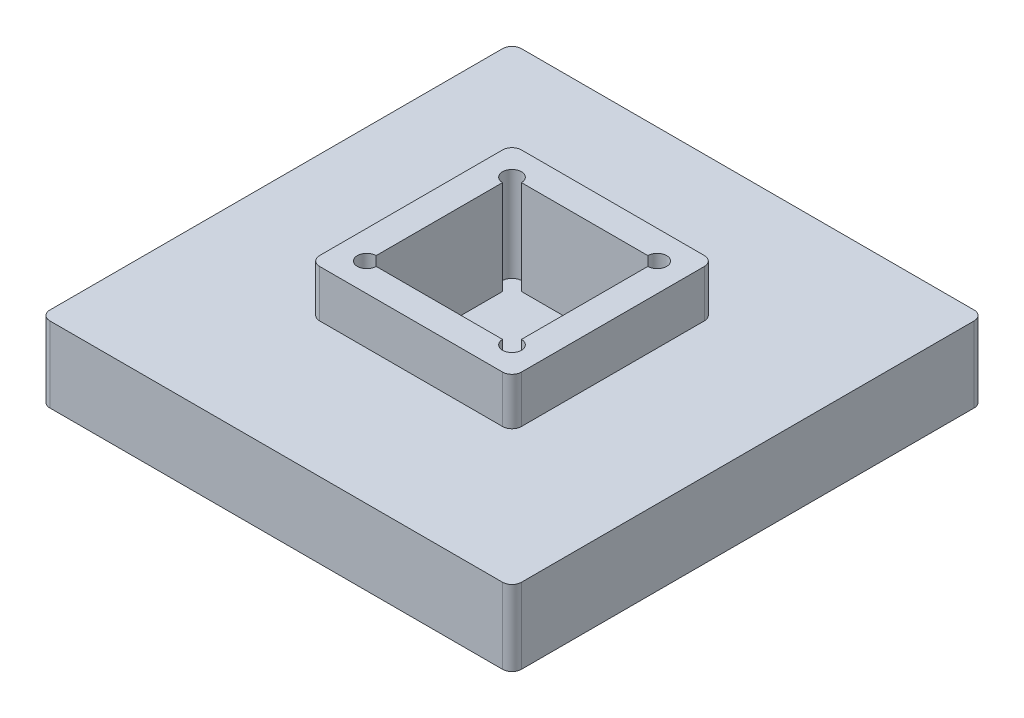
ISO-10303-21;
HEADER;
FILE_DESCRIPTION(('STEP AP214'),'2;1');
FILE_NAME('part.step','',(''),(''),'','','');
FILE_SCHEMA(('AUTOMOTIVE_DESIGN { 1 0 10303 214 1 1 1 1 }'));
ENDSEC;
DATA;
#1=APPLICATION_CONTEXT('core data for automotive mechanical design processes');
#2=APPLICATION_PROTOCOL_DEFINITION('international standard','automotive_design',2000,#1);
#3=PRODUCT_CONTEXT('',#1,'mechanical');
#4=PRODUCT('Part','Part','',(#3));
#5=PRODUCT_RELATED_PRODUCT_CATEGORY('part','',(#4));
#6=PRODUCT_DEFINITION_FORMATION('','',#4);
#7=PRODUCT_DEFINITION_CONTEXT('part definition',#1,'design');
#8=PRODUCT_DEFINITION('design','',#6,#7);
#9=PRODUCT_DEFINITION_SHAPE('','',#8);
#10=(LENGTH_UNIT() NAMED_UNIT(*) SI_UNIT(.MILLI.,.METRE.));
#11=(NAMED_UNIT(*) PLANE_ANGLE_UNIT() SI_UNIT($,.RADIAN.));
#12=(NAMED_UNIT(*) SI_UNIT($,.STERADIAN.) SOLID_ANGLE_UNIT());
#13=UNCERTAINTY_MEASURE_WITH_UNIT(LENGTH_MEASURE(1.E-05),#10,'distance_accuracy_value','');
#14=(GEOMETRIC_REPRESENTATION_CONTEXT(3) GLOBAL_UNCERTAINTY_ASSIGNED_CONTEXT((#13)) GLOBAL_UNIT_ASSIGNED_CONTEXT((#10,
#11,#12)) REPRESENTATION_CONTEXT('',''));
#15=CARTESIAN_POINT('',(0.,0.,0.));
#16=DIRECTION('',(0.,0.,1.));
#17=DIRECTION('',(1.,0.,0.));
#18=AXIS2_PLACEMENT_3D('',#15,#16,#17);
#19=CARTESIAN_POINT('',(0.,8.,0.));
#20=DIRECTION('',(0.,-1.,0.));
#21=DIRECTION('',(0.,0.,-1.));
#22=AXIS2_PLACEMENT_3D('',#19,#20,#21);
#23=PLANE('',#22);
#24=DIRECTION('',(-1.,0.,0.));
#25=VECTOR('',#24,1.);
#26=CARTESIAN_POINT('',(-25.,8.,-25.));
#27=LINE('',#26,#25);
#28=CARTESIAN_POINT('',(24.,8.,-25.));
#29=VERTEX_POINT('',#28);
#30=CARTESIAN_POINT('',(-24.,8.,-25.));
#31=VERTEX_POINT('',#30);
#32=EDGE_CURVE('E299',#29,#31,#27,.T.);
#33=ORIENTED_EDGE('',*,*,#32,.T.);
#34=CARTESIAN_POINT('',(-24.,8.,-24.));
#35=DIRECTION('',(0.,-1.,0.));
#36=DIRECTION('',(0.,0.,-1.));
#37=AXIS2_PLACEMENT_3D('',#34,#35,#36);
#38=CIRCLE('',#37,1.);
#39=CARTESIAN_POINT('',(-25.,8.,-24.));
#40=VERTEX_POINT('',#39);
#41=EDGE_CURVE('E367',#31,#40,#38,.F.);
#42=ORIENTED_EDGE('',*,*,#41,.T.);
#43=DIRECTION('',(0.,0.,1.));
#44=VECTOR('',#43,1.);
#45=CARTESIAN_POINT('',(-25.,8.,25.));
#46=LINE('',#45,#44);
#47=CARTESIAN_POINT('',(-25.,8.,24.));
#48=VERTEX_POINT('',#47);
#49=EDGE_CURVE('E303',#40,#48,#46,.T.);
#50=ORIENTED_EDGE('',*,*,#49,.T.);
#51=CARTESIAN_POINT('',(-24.,8.,24.));
#52=DIRECTION('',(0.,-1.,0.));
#53=DIRECTION('',(0.,0.,-1.));
#54=AXIS2_PLACEMENT_3D('',#51,#52,#53);
#55=CIRCLE('',#54,1.);
#56=CARTESIAN_POINT('',(-24.,8.,25.));
#57=VERTEX_POINT('',#56);
#58=EDGE_CURVE('E58',#48,#57,#55,.F.);
#59=ORIENTED_EDGE('',*,*,#58,.T.);
#60=DIRECTION('',(1.,0.,0.));
#61=VECTOR('',#60,1.);
#62=CARTESIAN_POINT('',(-25.,8.,25.));
#63=LINE('',#62,#61);
#64=CARTESIAN_POINT('',(24.,8.,25.));
#65=VERTEX_POINT('',#64);
#66=EDGE_CURVE('E305',#57,#65,#63,.T.);
#67=ORIENTED_EDGE('',*,*,#66,.T.);
#68=CARTESIAN_POINT('',(24.,8.,24.));
#69=DIRECTION('',(0.,-1.,0.));
#70=DIRECTION('',(0.,0.,-1.));
#71=AXIS2_PLACEMENT_3D('',#68,#69,#70);
#72=CIRCLE('',#71,1.);
#73=CARTESIAN_POINT('',(25.,8.,24.));
#74=VERTEX_POINT('',#73);
#75=EDGE_CURVE('E364',#65,#74,#72,.F.);
#76=ORIENTED_EDGE('',*,*,#75,.T.);
#77=DIRECTION('',(0.,0.,-1.));
#78=VECTOR('',#77,1.);
#79=CARTESIAN_POINT('',(25.,8.,25.));
#80=LINE('',#79,#78);
#81=CARTESIAN_POINT('',(25.,8.,-24.));
#82=VERTEX_POINT('',#81);
#83=EDGE_CURVE('E296',#74,#82,#80,.T.);
#84=ORIENTED_EDGE('',*,*,#83,.T.);
#85=CARTESIAN_POINT('',(24.,8.,-24.));
#86=DIRECTION('',(0.,-1.,0.));
#87=DIRECTION('',(0.,0.,-1.));
#88=AXIS2_PLACEMENT_3D('',#85,#86,#87);
#89=CIRCLE('',#88,1.);
#90=EDGE_CURVE('E362',#82,#29,#89,.F.);
#91=ORIENTED_EDGE('',*,*,#90,.T.);
#92=EDGE_LOOP('',(#33,#42,#50,#59,#67,#76,#84,#91));
#93=FACE_BOUND('',#92,.T.);
#94=DIRECTION('',(1.,0.,0.));
#95=VECTOR('',#94,1.);
#96=CARTESIAN_POINT('',(0.,8.,10.7));
#97=LINE('',#96,#95);
#98=CARTESIAN_POINT('',(-9.7,8.,10.7));
#99=VERTEX_POINT('',#98);
#100=CARTESIAN_POINT('',(9.7,8.,10.7));
#101=VERTEX_POINT('',#100);
#102=EDGE_CURVE('E239',#99,#101,#97,.T.);
#103=ORIENTED_EDGE('',*,*,#102,.F.);
#104=CARTESIAN_POINT('',(-9.7,8.,9.7));
#105=DIRECTION('',(0.,-1.,0.));
#106=DIRECTION('',(0.,0.,-1.));
#107=AXIS2_PLACEMENT_3D('',#104,#105,#106);
#108=CIRCLE('',#107,1.);
#109=CARTESIAN_POINT('',(-10.7,8.,9.7));
#110=VERTEX_POINT('',#109);
#111=EDGE_CURVE('E11',#99,#110,#108,.T.);
#112=ORIENTED_EDGE('',*,*,#111,.T.);
#113=DIRECTION('',(0.,0.,-1.));
#114=VECTOR('',#113,1.);
#115=CARTESIAN_POINT('',(-10.7,8.,0.));
#116=LINE('',#115,#114);
#117=CARTESIAN_POINT('',(-10.7,8.,-9.7));
#118=VERTEX_POINT('',#117);
#119=EDGE_CURVE('E244',#110,#118,#116,.T.);
#120=ORIENTED_EDGE('',*,*,#119,.T.);
#121=CARTESIAN_POINT('',(-9.7,8.,-9.7));
#122=DIRECTION('',(0.,-1.,0.));
#123=DIRECTION('',(0.,0.,-1.));
#124=AXIS2_PLACEMENT_3D('',#121,#122,#123);
#125=CIRCLE('',#124,1.);
#126=CARTESIAN_POINT('',(-9.7,8.,-10.7));
#127=VERTEX_POINT('',#126);
#128=EDGE_CURVE('E44',#118,#127,#125,.T.);
#129=ORIENTED_EDGE('',*,*,#128,.T.);
#130=DIRECTION('',(1.,0.,0.));
#131=VECTOR('',#130,1.);
#132=CARTESIAN_POINT('',(0.,8.,-10.7));
#133=LINE('',#132,#131);
#134=CARTESIAN_POINT('',(9.7,8.,-10.7));
#135=VERTEX_POINT('',#134);
#136=EDGE_CURVE('E279',#127,#135,#133,.T.);
#137=ORIENTED_EDGE('',*,*,#136,.T.);
#138=CARTESIAN_POINT('',(9.7,8.,-9.7));
#139=DIRECTION('',(0.,-1.,0.));
#140=DIRECTION('',(0.,0.,-1.));
#141=AXIS2_PLACEMENT_3D('',#138,#139,#140);
#142=CIRCLE('',#141,1.);
#143=CARTESIAN_POINT('',(10.7,8.,-9.7));
#144=VERTEX_POINT('',#143);
#145=EDGE_CURVE('E380',#135,#144,#142,.T.);
#146=ORIENTED_EDGE('',*,*,#145,.T.);
#147=DIRECTION('',(0.,0.,-1.));
#148=VECTOR('',#147,1.);
#149=CARTESIAN_POINT('',(10.7,8.,0.));
#150=LINE('',#149,#148);
#151=CARTESIAN_POINT('',(10.7,8.,9.7));
#152=VERTEX_POINT('',#151);
#153=EDGE_CURVE('E276',#152,#144,#150,.T.);
#154=ORIENTED_EDGE('',*,*,#153,.F.);
#155=CARTESIAN_POINT('',(9.7,8.,9.7));
#156=DIRECTION('',(0.,-1.,0.));
#157=DIRECTION('',(0.,0.,-1.));
#158=AXIS2_PLACEMENT_3D('',#155,#156,#157);
#159=CIRCLE('',#158,1.);
#160=EDGE_CURVE('E378',#152,#101,#159,.T.);
#161=ORIENTED_EDGE('',*,*,#160,.T.);
#162=EDGE_LOOP('',(#103,#112,#120,#129,#137,#146,#154,#161));
#163=FACE_BOUND('',#162,.T.);
#164=ADVANCED_FACE('F36',(#93,#163),#23,.F.);
#165=CARTESIAN_POINT('',(25.,8.,25.));
#166=DIRECTION('',(-1.,0.,0.));
#167=DIRECTION('',(0.,0.,1.));
#168=AXIS2_PLACEMENT_3D('',#165,#166,#167);
#169=PLANE('',#168);
#170=ORIENTED_EDGE('',*,*,#83,.F.);
#171=DIRECTION('',(0.,-1.,0.));
#172=VECTOR('',#171,1.);
#173=CARTESIAN_POINT('',(25.,8.,24.));
#174=LINE('',#173,#172);
#175=CARTESIAN_POINT('',(25.,0.,24.));
#176=VERTEX_POINT('',#175);
#177=EDGE_CURVE('E375',#74,#176,#174,.T.);
#178=ORIENTED_EDGE('',*,*,#177,.T.);
#179=DIRECTION('',(0.,0.,-1.));
#180=VECTOR('',#179,1.);
#181=CARTESIAN_POINT('',(25.,0.,25.));
#182=LINE('',#181,#180);
#183=CARTESIAN_POINT('',(25.,0.,-24.));
#184=VERTEX_POINT('',#183);
#185=EDGE_CURVE('E295',#176,#184,#182,.T.);
#186=ORIENTED_EDGE('',*,*,#185,.T.);
#187=DIRECTION('',(0.,-1.,0.));
#188=VECTOR('',#187,1.);
#189=CARTESIAN_POINT('',(25.,8.,-24.));
#190=LINE('',#189,#188);
#191=EDGE_CURVE('E373',#184,#82,#190,.F.);
#192=ORIENTED_EDGE('',*,*,#191,.T.);
#193=EDGE_LOOP('',(#170,#178,#186,#192));
#194=FACE_BOUND('',#193,.T.);
#195=ADVANCED_FACE('F429',(#194),#169,.F.);
#196=CARTESIAN_POINT('',(-25.,8.,-25.));
#197=DIRECTION('',(0.,0.,1.));
#198=DIRECTION('',(1.,0.,0.));
#199=AXIS2_PLACEMENT_3D('',#196,#197,#198);
#200=PLANE('',#199);
#201=DIRECTION('',(-1.,0.,0.));
#202=VECTOR('',#201,1.);
#203=CARTESIAN_POINT('',(-25.,0.,-25.));
#204=LINE('',#203,#202);
#205=CARTESIAN_POINT('',(24.,0.,-25.));
#206=VERTEX_POINT('',#205);
#207=CARTESIAN_POINT('',(-24.,0.,-25.));
#208=VERTEX_POINT('',#207);
#209=EDGE_CURVE('E310',#206,#208,#204,.T.);
#210=ORIENTED_EDGE('',*,*,#209,.T.);
#211=DIRECTION('',(0.,-1.,0.));
#212=VECTOR('',#211,1.);
#213=CARTESIAN_POINT('',(-24.,8.,-25.));
#214=LINE('',#213,#212);
#215=EDGE_CURVE('E360',#208,#31,#214,.F.);
#216=ORIENTED_EDGE('',*,*,#215,.T.);
#217=ORIENTED_EDGE('',*,*,#32,.F.);
#218=DIRECTION('',(0.,-1.,0.));
#219=VECTOR('',#218,1.);
#220=CARTESIAN_POINT('',(24.,8.,-25.));
#221=LINE('',#220,#219);
#222=EDGE_CURVE('E357',#29,#206,#221,.T.);
#223=ORIENTED_EDGE('',*,*,#222,.T.);
#224=EDGE_LOOP('',(#210,#216,#217,#223));
#225=FACE_BOUND('',#224,.T.);
#226=ADVANCED_FACE('F434',(#225),#200,.F.);
#227=CARTESIAN_POINT('',(-25.,8.,25.));
#228=DIRECTION('',(1.,0.,0.));
#229=DIRECTION('',(0.,0.,-1.));
#230=AXIS2_PLACEMENT_3D('',#227,#228,#229);
#231=PLANE('',#230);
#232=ORIENTED_EDGE('',*,*,#49,.F.);
#233=DIRECTION('',(0.,-1.,0.));
#234=VECTOR('',#233,1.);
#235=CARTESIAN_POINT('',(-25.,8.,-24.));
#236=LINE('',#235,#234);
#237=CARTESIAN_POINT('',(-25.,0.,-24.));
#238=VERTEX_POINT('',#237);
#239=EDGE_CURVE('E346',#40,#238,#236,.T.);
#240=ORIENTED_EDGE('',*,*,#239,.T.);
#241=DIRECTION('',(0.,0.,1.));
#242=VECTOR('',#241,1.);
#243=CARTESIAN_POINT('',(-25.,0.,25.));
#244=LINE('',#243,#242);
#245=CARTESIAN_POINT('',(-25.,0.,24.));
#246=VERTEX_POINT('',#245);
#247=EDGE_CURVE('E313',#238,#246,#244,.T.);
#248=ORIENTED_EDGE('',*,*,#247,.T.);
#249=DIRECTION('',(0.,-1.,0.));
#250=VECTOR('',#249,1.);
#251=CARTESIAN_POINT('',(-25.,8.,24.));
#252=LINE('',#251,#250);
#253=EDGE_CURVE('E344',#246,#48,#252,.F.);
#254=ORIENTED_EDGE('',*,*,#253,.T.);
#255=EDGE_LOOP('',(#232,#240,#248,#254));
#256=FACE_BOUND('',#255,.T.);
#257=ADVANCED_FACE('F448',(#256),#231,.F.);
#258=CARTESIAN_POINT('',(-25.,8.,25.));
#259=DIRECTION('',(0.,0.,-1.));
#260=DIRECTION('',(-1.,0.,0.));
#261=AXIS2_PLACEMENT_3D('',#258,#259,#260);
#262=PLANE('',#261);
#263=ORIENTED_EDGE('',*,*,#66,.F.);
#264=DIRECTION('',(0.,-1.,0.));
#265=VECTOR('',#264,1.);
#266=CARTESIAN_POINT('',(-24.,8.,25.));
#267=LINE('',#266,#265);
#268=CARTESIAN_POINT('',(-24.,0.,25.));
#269=VERTEX_POINT('',#268);
#270=EDGE_CURVE('E370',#57,#269,#267,.T.);
#271=ORIENTED_EDGE('',*,*,#270,.T.);
#272=DIRECTION('',(1.,0.,0.));
#273=VECTOR('',#272,1.);
#274=CARTESIAN_POINT('',(-25.,0.,25.));
#275=LINE('',#274,#273);
#276=CARTESIAN_POINT('',(24.,0.,25.));
#277=VERTEX_POINT('',#276);
#278=EDGE_CURVE('E300',#269,#277,#275,.T.);
#279=ORIENTED_EDGE('',*,*,#278,.T.);
#280=DIRECTION('',(0.,-1.,0.));
#281=VECTOR('',#280,1.);
#282=CARTESIAN_POINT('',(24.,8.,25.));
#283=LINE('',#282,#281);
#284=EDGE_CURVE('E51',#277,#65,#283,.F.);
#285=ORIENTED_EDGE('',*,*,#284,.T.);
#286=EDGE_LOOP('',(#263,#271,#279,#285));
#287=FACE_BOUND('',#286,.T.);
#288=ADVANCED_FACE('F444',(#287),#262,.F.);
#289=CARTESIAN_POINT('',(0.,0.,0.));
#290=DIRECTION('',(0.,-1.,0.));
#291=DIRECTION('',(0.,0.,-1.));
#292=AXIS2_PLACEMENT_3D('',#289,#290,#291);
#293=PLANE('',#292);
#294=ORIENTED_EDGE('',*,*,#247,.F.);
#295=CARTESIAN_POINT('',(-24.,0.,-24.));
#296=DIRECTION('',(0.,-1.,0.));
#297=DIRECTION('',(0.,0.,-1.));
#298=AXIS2_PLACEMENT_3D('',#295,#296,#297);
#299=CIRCLE('',#298,1.);
#300=EDGE_CURVE('E355',#238,#208,#299,.T.);
#301=ORIENTED_EDGE('',*,*,#300,.T.);
#302=ORIENTED_EDGE('',*,*,#209,.F.);
#303=CARTESIAN_POINT('',(24.,0.,-24.));
#304=DIRECTION('',(0.,-1.,0.));
#305=DIRECTION('',(0.,0.,-1.));
#306=AXIS2_PLACEMENT_3D('',#303,#304,#305);
#307=CIRCLE('',#306,1.);
#308=EDGE_CURVE('E349',#206,#184,#307,.T.);
#309=ORIENTED_EDGE('',*,*,#308,.T.);
#310=ORIENTED_EDGE('',*,*,#185,.F.);
#311=CARTESIAN_POINT('',(24.,0.,24.));
#312=DIRECTION('',(0.,-1.,0.));
#313=DIRECTION('',(0.,0.,-1.));
#314=AXIS2_PLACEMENT_3D('',#311,#312,#313);
#315=CIRCLE('',#314,1.);
#316=EDGE_CURVE('E351',#176,#277,#315,.T.);
#317=ORIENTED_EDGE('',*,*,#316,.T.);
#318=ORIENTED_EDGE('',*,*,#278,.F.);
#319=CARTESIAN_POINT('',(-24.,0.,24.));
#320=DIRECTION('',(0.,-1.,0.));
#321=DIRECTION('',(0.,0.,-1.));
#322=AXIS2_PLACEMENT_3D('',#319,#320,#321);
#323=CIRCLE('',#322,1.);
#324=EDGE_CURVE('E353',#269,#246,#323,.T.);
#325=ORIENTED_EDGE('',*,*,#324,.T.);
#326=EDGE_LOOP('',(#294,#301,#302,#309,#310,#317,#318,#325));
#327=FACE_BOUND('',#326,.T.);
#328=ADVANCED_FACE('F441',(#327),#293,.T.);
#329=CARTESIAN_POINT('',(0.,13.,10.7));
#330=DIRECTION('',(0.,0.,-1.));
#331=DIRECTION('',(-1.,0.,0.));
#332=AXIS2_PLACEMENT_3D('',#329,#330,#331);
#333=PLANE('',#332);
#334=ORIENTED_EDGE('',*,*,#102,.T.);
#335=DIRECTION('',(0.,-1.,0.));
#336=VECTOR('',#335,1.);
#337=CARTESIAN_POINT('',(9.7,13.,10.7));
#338=LINE('',#337,#336);
#339=CARTESIAN_POINT('',(9.7,13.,10.7));
#340=VERTEX_POINT('',#339);
#341=EDGE_CURVE('E324',#101,#340,#338,.F.);
#342=ORIENTED_EDGE('',*,*,#341,.T.);
#343=DIRECTION('',(1.,0.,0.));
#344=VECTOR('',#343,1.);
#345=CARTESIAN_POINT('',(0.,13.,10.7));
#346=LINE('',#345,#344);
#347=CARTESIAN_POINT('',(-9.7,13.,10.7));
#348=VERTEX_POINT('',#347);
#349=EDGE_CURVE('E261',#348,#340,#346,.T.);
#350=ORIENTED_EDGE('',*,*,#349,.F.);
#351=DIRECTION('',(0.,-1.,0.));
#352=VECTOR('',#351,1.);
#353=CARTESIAN_POINT('',(-9.7,8.,10.7));
#354=LINE('',#353,#352);
#355=EDGE_CURVE('E321',#348,#99,#354,.T.);
#356=ORIENTED_EDGE('',*,*,#355,.T.);
#357=EDGE_LOOP('',(#334,#342,#350,#356));
#358=FACE_BOUND('',#357,.T.);
#359=ADVANCED_FACE('F407',(#358),#333,.F.);
#360=CARTESIAN_POINT('',(10.7,13.,0.));
#361=DIRECTION('',(-1.,0.,0.));
#362=DIRECTION('',(0.,0.,1.));
#363=AXIS2_PLACEMENT_3D('',#360,#361,#362);
#364=PLANE('',#363);
#365=DIRECTION('',(0.,0.,-1.));
#366=VECTOR('',#365,1.);
#367=CARTESIAN_POINT('',(10.7,13.,0.));
#368=LINE('',#367,#366);
#369=CARTESIAN_POINT('',(10.7,13.,9.7));
#370=VERTEX_POINT('',#369);
#371=CARTESIAN_POINT('',(10.7,13.,-9.7));
#372=VERTEX_POINT('',#371);
#373=EDGE_CURVE('E264',#370,#372,#368,.T.);
#374=ORIENTED_EDGE('',*,*,#373,.F.);
#375=DIRECTION('',(0.,-1.,0.));
#376=VECTOR('',#375,1.);
#377=CARTESIAN_POINT('',(10.7,13.,9.7));
#378=LINE('',#377,#376);
#379=EDGE_CURVE('E318',#370,#152,#378,.T.);
#380=ORIENTED_EDGE('',*,*,#379,.T.);
#381=ORIENTED_EDGE('',*,*,#153,.T.);
#382=DIRECTION('',(0.,-1.,0.));
#383=VECTOR('',#382,1.);
#384=CARTESIAN_POINT('',(10.7,13.,-9.7));
#385=LINE('',#384,#383);
#386=EDGE_CURVE('E307',#144,#372,#385,.F.);
#387=ORIENTED_EDGE('',*,*,#386,.T.);
#388=EDGE_LOOP('',(#374,#380,#381,#387));
#389=FACE_BOUND('',#388,.T.);
#390=ADVANCED_FACE('F415',(#389),#364,.F.);
#391=CARTESIAN_POINT('',(0.,13.,-10.7));
#392=DIRECTION('',(0.,0.,-1.));
#393=DIRECTION('',(-1.,0.,0.));
#394=AXIS2_PLACEMENT_3D('',#391,#392,#393);
#395=PLANE('',#394);
#396=DIRECTION('',(1.,0.,0.));
#397=VECTOR('',#396,1.);
#398=CARTESIAN_POINT('',(0.,13.,-10.7));
#399=LINE('',#398,#397);
#400=CARTESIAN_POINT('',(-9.7,13.,-10.7));
#401=VERTEX_POINT('',#400);
#402=CARTESIAN_POINT('',(9.7,13.,-10.7));
#403=VERTEX_POINT('',#402);
#404=EDGE_CURVE('E267',#401,#403,#399,.T.);
#405=ORIENTED_EDGE('',*,*,#404,.T.);
#406=DIRECTION('',(0.,-1.,0.));
#407=VECTOR('',#406,1.);
#408=CARTESIAN_POINT('',(9.7,8.,-10.7));
#409=LINE('',#408,#407);
#410=EDGE_CURVE('E336',#403,#135,#409,.T.);
#411=ORIENTED_EDGE('',*,*,#410,.T.);
#412=ORIENTED_EDGE('',*,*,#136,.F.);
#413=DIRECTION('',(0.,-1.,0.));
#414=VECTOR('',#413,1.);
#415=CARTESIAN_POINT('',(-9.7,13.,-10.7));
#416=LINE('',#415,#414);
#417=EDGE_CURVE('E334',#127,#401,#416,.F.);
#418=ORIENTED_EDGE('',*,*,#417,.T.);
#419=EDGE_LOOP('',(#405,#411,#412,#418));
#420=FACE_BOUND('',#419,.T.);
#421=ADVANCED_FACE('F389',(#420),#395,.T.);
#422=CARTESIAN_POINT('',(-7.7,13.,7.7));
#423=DIRECTION('',(0.,-1.,0.));
#424=DIRECTION('',(0.,0.,-1.));
#425=AXIS2_PLACEMENT_3D('',#422,#423,#424);
#426=CYLINDRICAL_SURFACE('',#425,1.);
#427=DIRECTION('',(0.,-1.,0.));
#428=VECTOR('',#427,1.);
#429=CARTESIAN_POINT('',(-6.7,13.,7.7));
#430=LINE('',#429,#428);
#431=CARTESIAN_POINT('',(-6.7,13.,7.7));
#432=VERTEX_POINT('',#431);
#433=CARTESIAN_POINT('',(-6.7,3.,7.7));
#434=VERTEX_POINT('',#433);
#435=EDGE_CURVE('E273',#432,#434,#430,.T.);
#436=ORIENTED_EDGE('',*,*,#435,.T.);
#437=CARTESIAN_POINT('',(-7.7,3.,7.7));
#438=DIRECTION('',(0.,1.,0.));
#439=DIRECTION('',(0.,0.,1.));
#440=AXIS2_PLACEMENT_3D('',#437,#438,#439);
#441=CIRCLE('',#440,1.);
#442=CARTESIAN_POINT('',(-7.7,3.,6.7));
#443=VERTEX_POINT('',#442);
#444=EDGE_CURVE('E218',#443,#434,#441,.T.);
#445=ORIENTED_EDGE('',*,*,#444,.F.);
#446=DIRECTION('',(0.,-1.,0.));
#447=VECTOR('',#446,1.);
#448=CARTESIAN_POINT('',(-7.7,13.,6.7));
#449=LINE('',#448,#447);
#450=CARTESIAN_POINT('',(-7.7,13.,6.7));
#451=VERTEX_POINT('',#450);
#452=EDGE_CURVE('E209',#451,#443,#449,.T.);
#453=ORIENTED_EDGE('',*,*,#452,.F.);
#454=CARTESIAN_POINT('',(-7.7,13.,7.7));
#455=DIRECTION('',(0.,1.,0.));
#456=DIRECTION('',(0.,0.,1.));
#457=AXIS2_PLACEMENT_3D('',#454,#455,#456);
#458=CIRCLE('',#457,1.);
#459=EDGE_CURVE('E240',#451,#432,#458,.T.);
#460=ORIENTED_EDGE('',*,*,#459,.T.);
#461=EDGE_LOOP('',(#436,#445,#453,#460));
#462=FACE_BOUND('',#461,.T.);
#463=ADVANCED_FACE('F439',(#462),#426,.F.);
#464=CARTESIAN_POINT('',(-7.7,13.,0.));
#465=DIRECTION('',(-1.,0.,0.));
#466=DIRECTION('',(0.,0.,1.));
#467=AXIS2_PLACEMENT_3D('',#464,#465,#466);
#468=PLANE('',#467);
#469=ORIENTED_EDGE('',*,*,#452,.T.);
#470=DIRECTION('',(0.,0.,1.));
#471=VECTOR('',#470,1.);
#472=CARTESIAN_POINT('',(-7.7,3.,-6.7));
#473=LINE('',#472,#471);
#474=CARTESIAN_POINT('',(-7.7,3.,-6.7));
#475=VERTEX_POINT('',#474);
#476=EDGE_CURVE('E213',#475,#443,#473,.T.);
#477=ORIENTED_EDGE('',*,*,#476,.F.);
#478=DIRECTION('',(0.,-1.,0.));
#479=VECTOR('',#478,1.);
#480=CARTESIAN_POINT('',(-7.7,13.,-6.7));
#481=LINE('',#480,#479);
#482=CARTESIAN_POINT('',(-7.7,13.,-6.7));
#483=VERTEX_POINT('',#482);
#484=EDGE_CURVE('E199',#483,#475,#481,.T.);
#485=ORIENTED_EDGE('',*,*,#484,.F.);
#486=DIRECTION('',(0.,0.,-1.));
#487=VECTOR('',#486,1.);
#488=CARTESIAN_POINT('',(-7.7,13.,0.));
#489=LINE('',#488,#487);
#490=EDGE_CURVE('E243',#451,#483,#489,.T.);
#491=ORIENTED_EDGE('',*,*,#490,.F.);
#492=EDGE_LOOP('',(#469,#477,#485,#491));
#493=FACE_BOUND('',#492,.T.);
#494=ADVANCED_FACE('F214',(#493),#468,.F.);
#495=CARTESIAN_POINT('',(-7.7,13.,-7.7));
#496=DIRECTION('',(0.,-1.,0.));
#497=DIRECTION('',(0.,0.,-1.));
#498=AXIS2_PLACEMENT_3D('',#495,#496,#497);
#499=CYLINDRICAL_SURFACE('',#498,1.);
#500=ORIENTED_EDGE('',*,*,#484,.T.);
#501=CARTESIAN_POINT('',(-7.7,3.,-7.7));
#502=DIRECTION('',(0.,1.,0.));
#503=DIRECTION('',(0.,0.,1.));
#504=AXIS2_PLACEMENT_3D('',#501,#502,#503);
#505=CIRCLE('',#504,1.);
#506=CARTESIAN_POINT('',(-6.7,3.,-7.7));
#507=VERTEX_POINT('',#506);
#508=EDGE_CURVE('E203',#507,#475,#505,.T.);
#509=ORIENTED_EDGE('',*,*,#508,.F.);
#510=DIRECTION('',(0.,-1.,0.));
#511=VECTOR('',#510,1.);
#512=CARTESIAN_POINT('',(-6.7,13.,-7.7));
#513=LINE('',#512,#511);
#514=CARTESIAN_POINT('',(-6.7,13.,-7.7));
#515=VERTEX_POINT('',#514);
#516=EDGE_CURVE('E210',#515,#507,#513,.T.);
#517=ORIENTED_EDGE('',*,*,#516,.F.);
#518=CARTESIAN_POINT('',(-7.7,13.,-7.7));
#519=DIRECTION('',(0.,1.,0.));
#520=DIRECTION('',(0.,0.,1.));
#521=AXIS2_PLACEMENT_3D('',#518,#519,#520);
#522=CIRCLE('',#521,1.);
#523=EDGE_CURVE('E206',#515,#483,#522,.T.);
#524=ORIENTED_EDGE('',*,*,#523,.T.);
#525=EDGE_LOOP('',(#500,#509,#517,#524));
#526=FACE_BOUND('',#525,.T.);
#527=ADVANCED_FACE('F201',(#526),#499,.F.);
#528=CARTESIAN_POINT('',(0.,13.,-7.7));
#529=DIRECTION('',(0.,0.,-1.));
#530=DIRECTION('',(-1.,0.,0.));
#531=AXIS2_PLACEMENT_3D('',#528,#529,#530);
#532=PLANE('',#531);
#533=ORIENTED_EDGE('',*,*,#516,.T.);
#534=DIRECTION('',(-1.,0.,0.));
#535=VECTOR('',#534,1.);
#536=CARTESIAN_POINT('',(6.7,3.,-7.7));
#537=LINE('',#536,#535);
#538=CARTESIAN_POINT('',(6.7,3.,-7.7));
#539=VERTEX_POINT('',#538);
#540=EDGE_CURVE('E223',#539,#507,#537,.T.);
#541=ORIENTED_EDGE('',*,*,#540,.F.);
#542=DIRECTION('',(0.,-1.,0.));
#543=VECTOR('',#542,1.);
#544=CARTESIAN_POINT('',(6.7,13.,-7.7));
#545=LINE('',#544,#543);
#546=CARTESIAN_POINT('',(6.7,13.,-7.7));
#547=VERTEX_POINT('',#546);
#548=EDGE_CURVE('E291',#547,#539,#545,.T.);
#549=ORIENTED_EDGE('',*,*,#548,.F.);
#550=DIRECTION('',(1.,0.,0.));
#551=VECTOR('',#550,1.);
#552=CARTESIAN_POINT('',(0.,13.,-7.7));
#553=LINE('',#552,#551);
#554=EDGE_CURVE('E247',#515,#547,#553,.T.);
#555=ORIENTED_EDGE('',*,*,#554,.F.);
#556=EDGE_LOOP('',(#533,#541,#549,#555));
#557=FACE_BOUND('',#556,.T.);
#558=ADVANCED_FACE('F541',(#557),#532,.F.);
#559=CARTESIAN_POINT('',(7.7,13.,-7.7));
#560=DIRECTION('',(0.,-1.,0.));
#561=DIRECTION('',(0.,0.,-1.));
#562=AXIS2_PLACEMENT_3D('',#559,#560,#561);
#563=CYLINDRICAL_SURFACE('',#562,1.);
#564=ORIENTED_EDGE('',*,*,#548,.T.);
#565=CARTESIAN_POINT('',(7.7,3.,-7.7));
#566=DIRECTION('',(0.,1.,0.));
#567=DIRECTION('',(0.,0.,1.));
#568=AXIS2_PLACEMENT_3D('',#565,#566,#567);
#569=CIRCLE('',#568,1.);
#570=CARTESIAN_POINT('',(7.7,3.,-6.7));
#571=VERTEX_POINT('',#570);
#572=EDGE_CURVE('E236',#571,#539,#569,.T.);
#573=ORIENTED_EDGE('',*,*,#572,.F.);
#574=DIRECTION('',(0.,-1.,0.));
#575=VECTOR('',#574,1.);
#576=CARTESIAN_POINT('',(7.7,13.,-6.7));
#577=LINE('',#576,#575);
#578=CARTESIAN_POINT('',(7.7,13.,-6.7));
#579=VERTEX_POINT('',#578);
#580=EDGE_CURVE('E289',#579,#571,#577,.T.);
#581=ORIENTED_EDGE('',*,*,#580,.F.);
#582=CARTESIAN_POINT('',(7.7,13.,-7.7));
#583=DIRECTION('',(0.,1.,0.));
#584=DIRECTION('',(0.,0.,1.));
#585=AXIS2_PLACEMENT_3D('',#582,#583,#584);
#586=CIRCLE('',#585,1.);
#587=EDGE_CURVE('E249',#579,#547,#586,.T.);
#588=ORIENTED_EDGE('',*,*,#587,.T.);
#589=EDGE_LOOP('',(#564,#573,#581,#588));
#590=FACE_BOUND('',#589,.T.);
#591=ADVANCED_FACE('F551',(#590),#563,.F.);
#592=CARTESIAN_POINT('',(7.7,13.,0.));
#593=DIRECTION('',(-1.,0.,0.));
#594=DIRECTION('',(0.,0.,1.));
#595=AXIS2_PLACEMENT_3D('',#592,#593,#594);
#596=PLANE('',#595);
#597=ORIENTED_EDGE('',*,*,#580,.T.);
#598=DIRECTION('',(0.,0.,-1.));
#599=VECTOR('',#598,1.);
#600=CARTESIAN_POINT('',(7.7,3.,6.7));
#601=LINE('',#600,#599);
#602=CARTESIAN_POINT('',(7.7,3.,6.7));
#603=VERTEX_POINT('',#602);
#604=EDGE_CURVE('E233',#603,#571,#601,.T.);
#605=ORIENTED_EDGE('',*,*,#604,.F.);
#606=DIRECTION('',(0.,-1.,0.));
#607=VECTOR('',#606,1.);
#608=CARTESIAN_POINT('',(7.7,13.,6.7));
#609=LINE('',#608,#607);
#610=CARTESIAN_POINT('',(7.7,13.,6.7));
#611=VERTEX_POINT('',#610);
#612=EDGE_CURVE('E287',#611,#603,#609,.T.);
#613=ORIENTED_EDGE('',*,*,#612,.F.);
#614=DIRECTION('',(0.,0.,-1.));
#615=VECTOR('',#614,1.);
#616=CARTESIAN_POINT('',(7.7,13.,0.));
#617=LINE('',#616,#615);
#618=EDGE_CURVE('E252',#611,#579,#617,.T.);
#619=ORIENTED_EDGE('',*,*,#618,.T.);
#620=EDGE_LOOP('',(#597,#605,#613,#619));
#621=FACE_BOUND('',#620,.T.);
#622=ADVANCED_FACE('F562',(#621),#596,.T.);
#623=CARTESIAN_POINT('',(7.7,13.,7.7));
#624=DIRECTION('',(0.,-1.,0.));
#625=DIRECTION('',(0.,0.,-1.));
#626=AXIS2_PLACEMENT_3D('',#623,#624,#625);
#627=CYLINDRICAL_SURFACE('',#626,1.);
#628=ORIENTED_EDGE('',*,*,#612,.T.);
#629=CARTESIAN_POINT('',(7.7,3.,7.7));
#630=DIRECTION('',(0.,1.,0.));
#631=DIRECTION('',(0.,0.,1.));
#632=AXIS2_PLACEMENT_3D('',#629,#630,#631);
#633=CIRCLE('',#632,1.);
#634=CARTESIAN_POINT('',(6.7,3.,7.7));
#635=VERTEX_POINT('',#634);
#636=EDGE_CURVE('E230',#635,#603,#633,.T.);
#637=ORIENTED_EDGE('',*,*,#636,.F.);
#638=DIRECTION('',(0.,-1.,0.));
#639=VECTOR('',#638,1.);
#640=CARTESIAN_POINT('',(6.7,13.,7.7));
#641=LINE('',#640,#639);
#642=CARTESIAN_POINT('',(6.7,13.,7.7));
#643=VERTEX_POINT('',#642);
#644=EDGE_CURVE('E285',#643,#635,#641,.T.);
#645=ORIENTED_EDGE('',*,*,#644,.F.);
#646=CARTESIAN_POINT('',(7.7,13.,7.7));
#647=DIRECTION('',(0.,1.,0.));
#648=DIRECTION('',(0.,0.,1.));
#649=AXIS2_PLACEMENT_3D('',#646,#647,#648);
#650=CIRCLE('',#649,1.);
#651=EDGE_CURVE('E255',#643,#611,#650,.T.);
#652=ORIENTED_EDGE('',*,*,#651,.T.);
#653=EDGE_LOOP('',(#628,#637,#645,#652));
#654=FACE_BOUND('',#653,.T.);
#655=ADVANCED_FACE('F573',(#654),#627,.F.);
#656=CARTESIAN_POINT('',(0.,13.,7.7));
#657=DIRECTION('',(0.,0.,-1.));
#658=DIRECTION('',(-1.,0.,0.));
#659=AXIS2_PLACEMENT_3D('',#656,#657,#658);
#660=PLANE('',#659);
#661=ORIENTED_EDGE('',*,*,#644,.T.);
#662=DIRECTION('',(1.,0.,0.));
#663=VECTOR('',#662,1.);
#664=CARTESIAN_POINT('',(-6.7,3.,7.7));
#665=LINE('',#664,#663);
#666=EDGE_CURVE('E227',#434,#635,#665,.T.);
#667=ORIENTED_EDGE('',*,*,#666,.F.);
#668=ORIENTED_EDGE('',*,*,#435,.F.);
#669=DIRECTION('',(1.,0.,0.));
#670=VECTOR('',#669,1.);
#671=CARTESIAN_POINT('',(0.,13.,7.7));
#672=LINE('',#671,#670);
#673=EDGE_CURVE('E258',#432,#643,#672,.T.);
#674=ORIENTED_EDGE('',*,*,#673,.T.);
#675=EDGE_LOOP('',(#661,#667,#668,#674));
#676=FACE_BOUND('',#675,.T.);
#677=ADVANCED_FACE('F584',(#676),#660,.T.);
#678=CARTESIAN_POINT('',(-10.7,13.,0.));
#679=DIRECTION('',(-1.,0.,0.));
#680=DIRECTION('',(0.,0.,1.));
#681=AXIS2_PLACEMENT_3D('',#678,#679,#680);
#682=PLANE('',#681);
#683=DIRECTION('',(0.,0.,-1.));
#684=VECTOR('',#683,1.);
#685=CARTESIAN_POINT('',(-10.7,13.,0.));
#686=LINE('',#685,#684);
#687=CARTESIAN_POINT('',(-10.7,13.,9.7));
#688=VERTEX_POINT('',#687);
#689=CARTESIAN_POINT('',(-10.7,13.,-9.7));
#690=VERTEX_POINT('',#689);
#691=EDGE_CURVE('E270',#688,#690,#686,.T.);
#692=ORIENTED_EDGE('',*,*,#691,.T.);
#693=DIRECTION('',(0.,-1.,0.));
#694=VECTOR('',#693,1.);
#695=CARTESIAN_POINT('',(-10.7,13.,-9.7));
#696=LINE('',#695,#694);
#697=EDGE_CURVE('E341',#690,#118,#696,.T.);
#698=ORIENTED_EDGE('',*,*,#697,.T.);
#699=ORIENTED_EDGE('',*,*,#119,.F.);
#700=DIRECTION('',(0.,-1.,0.));
#701=VECTOR('',#700,1.);
#702=CARTESIAN_POINT('',(-10.7,13.,9.7));
#703=LINE('',#702,#701);
#704=EDGE_CURVE('E339',#110,#688,#703,.F.);
#705=ORIENTED_EDGE('',*,*,#704,.T.);
#706=EDGE_LOOP('',(#692,#698,#699,#705));
#707=FACE_BOUND('',#706,.T.);
#708=ADVANCED_FACE('F399',(#707),#682,.T.);
#709=CARTESIAN_POINT('',(0.,13.,0.));
#710=DIRECTION('',(0.,1.,0.));
#711=DIRECTION('',(0.,0.,1.));
#712=AXIS2_PLACEMENT_3D('',#709,#710,#711);
#713=PLANE('',#712);
#714=ORIENTED_EDGE('',*,*,#459,.F.);
#715=ORIENTED_EDGE('',*,*,#490,.T.);
#716=ORIENTED_EDGE('',*,*,#523,.F.);
#717=ORIENTED_EDGE('',*,*,#554,.T.);
#718=ORIENTED_EDGE('',*,*,#587,.F.);
#719=ORIENTED_EDGE('',*,*,#618,.F.);
#720=ORIENTED_EDGE('',*,*,#651,.F.);
#721=ORIENTED_EDGE('',*,*,#673,.F.);
#722=EDGE_LOOP('',(#714,#715,#716,#717,#718,#719,#720,#721));
#723=FACE_BOUND('',#722,.T.);
#724=ORIENTED_EDGE('',*,*,#349,.T.);
#725=CARTESIAN_POINT('',(9.7,13.,9.7));
#726=DIRECTION('',(0.,1.,0.));
#727=DIRECTION('',(0.,0.,1.));
#728=AXIS2_PLACEMENT_3D('',#725,#726,#727);
#729=CIRCLE('',#728,1.);
#730=EDGE_CURVE('E332',#340,#370,#729,.T.);
#731=ORIENTED_EDGE('',*,*,#730,.T.);
#732=ORIENTED_EDGE('',*,*,#373,.T.);
#733=CARTESIAN_POINT('',(9.7,13.,-9.7));
#734=DIRECTION('',(0.,1.,0.));
#735=DIRECTION('',(0.,0.,1.));
#736=AXIS2_PLACEMENT_3D('',#733,#734,#735);
#737=CIRCLE('',#736,1.);
#738=EDGE_CURVE('E330',#372,#403,#737,.T.);
#739=ORIENTED_EDGE('',*,*,#738,.T.);
#740=ORIENTED_EDGE('',*,*,#404,.F.);
#741=CARTESIAN_POINT('',(-9.7,13.,-9.7));
#742=DIRECTION('',(0.,1.,0.));
#743=DIRECTION('',(0.,0.,1.));
#744=AXIS2_PLACEMENT_3D('',#741,#742,#743);
#745=CIRCLE('',#744,1.);
#746=EDGE_CURVE('E328',#401,#690,#745,.T.);
#747=ORIENTED_EDGE('',*,*,#746,.T.);
#748=ORIENTED_EDGE('',*,*,#691,.F.);
#749=CARTESIAN_POINT('',(-9.7,13.,9.7));
#750=DIRECTION('',(0.,1.,0.));
#751=DIRECTION('',(0.,0.,1.));
#752=AXIS2_PLACEMENT_3D('',#749,#750,#751);
#753=CIRCLE('',#752,1.);
#754=EDGE_CURVE('E326',#688,#348,#753,.T.);
#755=ORIENTED_EDGE('',*,*,#754,.T.);
#756=EDGE_LOOP('',(#724,#731,#732,#739,#740,#747,#748,#755));
#757=FACE_BOUND('',#756,.T.);
#758=ADVANCED_FACE('F396',(#723,#757),#713,.T.);
#759=CARTESIAN_POINT('',(9.7,13.,9.7));
#760=DIRECTION('',(0.,-1.,0.));
#761=DIRECTION('',(0.,0.,-1.));
#762=AXIS2_PLACEMENT_3D('',#759,#760,#761);
#763=CYLINDRICAL_SURFACE('',#762,1.);
#764=ORIENTED_EDGE('',*,*,#730,.F.);
#765=ORIENTED_EDGE('',*,*,#341,.F.);
#766=ORIENTED_EDGE('',*,*,#160,.F.);
#767=ORIENTED_EDGE('',*,*,#379,.F.);
#768=EDGE_LOOP('',(#764,#765,#766,#767));
#769=FACE_BOUND('',#768,.T.);
#770=ADVANCED_FACE('F410',(#769),#763,.T.);
#771=CARTESIAN_POINT('',(9.7,13.,-9.7));
#772=DIRECTION('',(0.,1.,0.));
#773=DIRECTION('',(0.,0.,1.));
#774=AXIS2_PLACEMENT_3D('',#771,#772,#773);
#775=CYLINDRICAL_SURFACE('',#774,1.);
#776=ORIENTED_EDGE('',*,*,#738,.F.);
#777=ORIENTED_EDGE('',*,*,#386,.F.);
#778=ORIENTED_EDGE('',*,*,#145,.F.);
#779=ORIENTED_EDGE('',*,*,#410,.F.);
#780=EDGE_LOOP('',(#776,#777,#778,#779));
#781=FACE_BOUND('',#780,.T.);
#782=ADVANCED_FACE('F419',(#781),#775,.T.);
#783=CARTESIAN_POINT('',(-9.7,13.,-9.7));
#784=DIRECTION('',(0.,-1.,0.));
#785=DIRECTION('',(0.,0.,-1.));
#786=AXIS2_PLACEMENT_3D('',#783,#784,#785);
#787=CYLINDRICAL_SURFACE('',#786,1.);
#788=ORIENTED_EDGE('',*,*,#746,.F.);
#789=ORIENTED_EDGE('',*,*,#417,.F.);
#790=ORIENTED_EDGE('',*,*,#128,.F.);
#791=ORIENTED_EDGE('',*,*,#697,.F.);
#792=EDGE_LOOP('',(#788,#789,#790,#791));
#793=FACE_BOUND('',#792,.T.);
#794=ADVANCED_FACE('F393',(#793),#787,.T.);
#795=CARTESIAN_POINT('',(-9.7,13.,9.7));
#796=DIRECTION('',(0.,1.,0.));
#797=DIRECTION('',(0.,0.,1.));
#798=AXIS2_PLACEMENT_3D('',#795,#796,#797);
#799=CYLINDRICAL_SURFACE('',#798,1.);
#800=ORIENTED_EDGE('',*,*,#754,.F.);
#801=ORIENTED_EDGE('',*,*,#704,.F.);
#802=ORIENTED_EDGE('',*,*,#111,.F.);
#803=ORIENTED_EDGE('',*,*,#355,.F.);
#804=EDGE_LOOP('',(#800,#801,#802,#803));
#805=FACE_BOUND('',#804,.T.);
#806=ADVANCED_FACE('F402',(#805),#799,.T.);
#807=CARTESIAN_POINT('',(-24.,8.,-24.));
#808=DIRECTION('',(0.,-1.,0.));
#809=DIRECTION('',(0.,0.,-1.));
#810=AXIS2_PLACEMENT_3D('',#807,#808,#809);
#811=CYLINDRICAL_SURFACE('',#810,1.);
#812=ORIENTED_EDGE('',*,*,#41,.F.);
#813=ORIENTED_EDGE('',*,*,#215,.F.);
#814=ORIENTED_EDGE('',*,*,#300,.F.);
#815=ORIENTED_EDGE('',*,*,#239,.F.);
#816=EDGE_LOOP('',(#812,#813,#814,#815));
#817=FACE_BOUND('',#816,.T.);
#818=ADVANCED_FACE('F462',(#817),#811,.T.);
#819=CARTESIAN_POINT('',(-24.,8.,24.));
#820=DIRECTION('',(0.,-1.,0.));
#821=DIRECTION('',(0.,0.,-1.));
#822=AXIS2_PLACEMENT_3D('',#819,#820,#821);
#823=CYLINDRICAL_SURFACE('',#822,1.);
#824=ORIENTED_EDGE('',*,*,#58,.F.);
#825=ORIENTED_EDGE('',*,*,#253,.F.);
#826=ORIENTED_EDGE('',*,*,#324,.F.);
#827=ORIENTED_EDGE('',*,*,#270,.F.);
#828=EDGE_LOOP('',(#824,#825,#826,#827));
#829=FACE_BOUND('',#828,.T.);
#830=ADVANCED_FACE('F468',(#829),#823,.T.);
#831=CARTESIAN_POINT('',(24.,8.,24.));
#832=DIRECTION('',(0.,-1.,0.));
#833=DIRECTION('',(0.,0.,-1.));
#834=AXIS2_PLACEMENT_3D('',#831,#832,#833);
#835=CYLINDRICAL_SURFACE('',#834,1.);
#836=ORIENTED_EDGE('',*,*,#75,.F.);
#837=ORIENTED_EDGE('',*,*,#284,.F.);
#838=ORIENTED_EDGE('',*,*,#316,.F.);
#839=ORIENTED_EDGE('',*,*,#177,.F.);
#840=EDGE_LOOP('',(#836,#837,#838,#839));
#841=FACE_BOUND('',#840,.T.);
#842=ADVANCED_FACE('F475',(#841),#835,.T.);
#843=CARTESIAN_POINT('',(24.,8.,-24.));
#844=DIRECTION('',(0.,-1.,0.));
#845=DIRECTION('',(0.,0.,-1.));
#846=AXIS2_PLACEMENT_3D('',#843,#844,#845);
#847=CYLINDRICAL_SURFACE('',#846,1.);
#848=ORIENTED_EDGE('',*,*,#90,.F.);
#849=ORIENTED_EDGE('',*,*,#191,.F.);
#850=ORIENTED_EDGE('',*,*,#308,.F.);
#851=ORIENTED_EDGE('',*,*,#222,.F.);
#852=EDGE_LOOP('',(#848,#849,#850,#851));
#853=FACE_BOUND('',#852,.T.);
#854=ADVANCED_FACE('F38',(#853),#847,.T.);
#855=CARTESIAN_POINT('',(-7.7,3.,-7.7));
#856=DIRECTION('',(0.,1.,0.));
#857=DIRECTION('',(0.,0.,1.));
#858=AXIS2_PLACEMENT_3D('',#855,#856,#857);
#859=PLANE('',#858);
#860=ORIENTED_EDGE('',*,*,#508,.T.);
#861=ORIENTED_EDGE('',*,*,#476,.T.);
#862=ORIENTED_EDGE('',*,*,#444,.T.);
#863=ORIENTED_EDGE('',*,*,#666,.T.);
#864=ORIENTED_EDGE('',*,*,#636,.T.);
#865=ORIENTED_EDGE('',*,*,#604,.T.);
#866=ORIENTED_EDGE('',*,*,#572,.T.);
#867=ORIENTED_EDGE('',*,*,#540,.T.);
#868=EDGE_LOOP('',(#860,#861,#862,#863,#864,#865,#866,#867));
#869=FACE_BOUND('',#868,.T.);
#870=ADVANCED_FACE('F220',(#869),#859,.T.);
#871=CLOSED_SHELL('',(#164,#195,#226,#257,#288,#328,#359,#390,#421,#463,#494,#527,#558,#591,
#622,#655,#677,#708,#758,#770,#782,#794,#806,#818,#830,#842,#854,#870));
#872=MANIFOLD_SOLID_BREP('B2',#871);
#873=ADVANCED_BREP_SHAPE_REPRESENTATION('',(#18,#872),#14);
#874=SHAPE_DEFINITION_REPRESENTATION(#9,#873);
ENDSEC;
END-ISO-10303-21;
